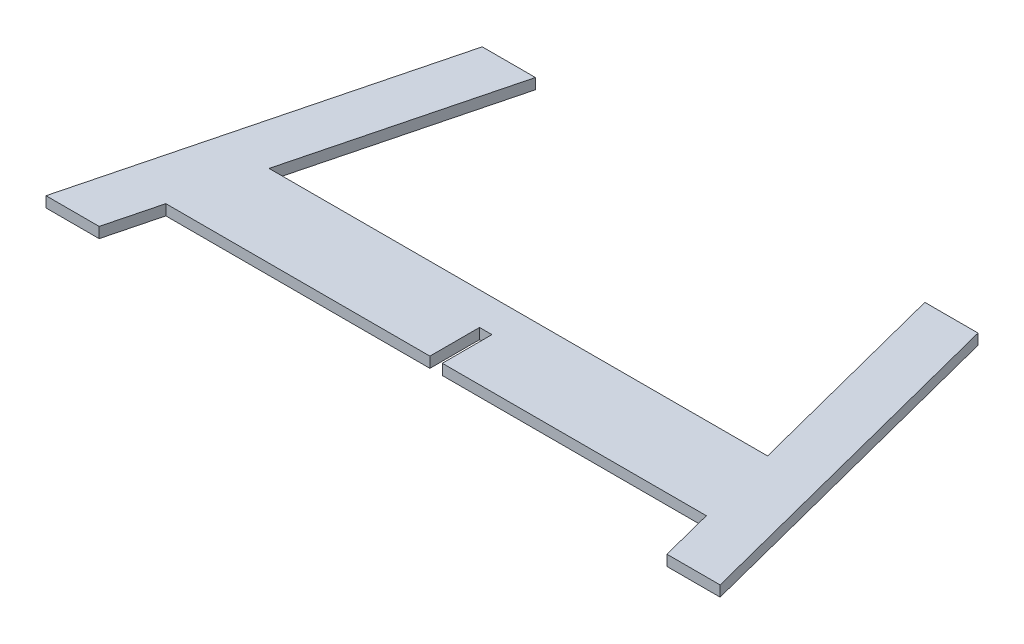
ISO-10303-21;
HEADER;
FILE_DESCRIPTION(('STEP AP214'),'2;1');
FILE_NAME('part.step','',(''),(''),'','','');
FILE_SCHEMA(('AUTOMOTIVE_DESIGN { 1 0 10303 214 1 1 1 1 }'));
ENDSEC;
DATA;
#1=APPLICATION_CONTEXT('core data for automotive mechanical design processes');
#2=APPLICATION_PROTOCOL_DEFINITION('international standard','automotive_design',2000,#1);
#3=PRODUCT_CONTEXT('',#1,'mechanical');
#4=PRODUCT('Part','Part','',(#3));
#5=PRODUCT_RELATED_PRODUCT_CATEGORY('part','',(#4));
#6=PRODUCT_DEFINITION_FORMATION('','',#4);
#7=PRODUCT_DEFINITION_CONTEXT('part definition',#1,'design');
#8=PRODUCT_DEFINITION('design','',#6,#7);
#9=PRODUCT_DEFINITION_SHAPE('','',#8);
#10=(LENGTH_UNIT() NAMED_UNIT(*) SI_UNIT(.MILLI.,.METRE.));
#11=(NAMED_UNIT(*) PLANE_ANGLE_UNIT() SI_UNIT($,.RADIAN.));
#12=(NAMED_UNIT(*) SI_UNIT($,.STERADIAN.) SOLID_ANGLE_UNIT());
#13=UNCERTAINTY_MEASURE_WITH_UNIT(LENGTH_MEASURE(1.E-05),#10,'distance_accuracy_value','');
#14=(GEOMETRIC_REPRESENTATION_CONTEXT(3) GLOBAL_UNCERTAINTY_ASSIGNED_CONTEXT((#13)) GLOBAL_UNIT_ASSIGNED_CONTEXT((#10,
#11,#12)) REPRESENTATION_CONTEXT('',''));
#15=CARTESIAN_POINT('',(0.,0.,0.));
#16=DIRECTION('',(0.,0.,1.));
#17=DIRECTION('',(1.,0.,0.));
#18=AXIS2_PLACEMENT_3D('',#15,#16,#17);
#19=CARTESIAN_POINT('',(-5.13148038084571,12.,-180.690415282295));
#20=DIRECTION('',(0.968532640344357,0.,0.248886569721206));
#21=DIRECTION('',(0.248886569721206,0.,-0.968532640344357));
#22=AXIS2_PLACEMENT_3D('',#19,#20,#21);
#23=PLANE('',#22);
#24=DIRECTION('',(-0.248886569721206,0.,0.968532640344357));
#25=VECTOR('',#24,1.);
#26=CARTESIAN_POINT('',(-5.13148038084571,0.,-180.690415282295));
#27=LINE('',#26,#25);
#28=CARTESIAN_POINT('',(-5.13148038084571,0.,-180.690415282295));
#29=VERTEX_POINT('',#28);
#30=CARTESIAN_POINT('',(-105.799867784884,0.,211.05679374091));
#31=VERTEX_POINT('',#30);
#32=EDGE_CURVE('E188',#29,#31,#27,.T.);
#33=ORIENTED_EDGE('',*,*,#32,.T.);
#34=DIRECTION('',(0.,-1.,0.));
#35=VECTOR('',#34,1.);
#36=CARTESIAN_POINT('',(-105.799867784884,12.,211.05679374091));
#37=LINE('',#36,#35);
#38=CARTESIAN_POINT('',(-105.799867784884,12.,211.05679374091));
#39=VERTEX_POINT('',#38);
#40=EDGE_CURVE('E11',#39,#31,#37,.T.);
#41=ORIENTED_EDGE('',*,*,#40,.F.);
#42=DIRECTION('',(-0.248886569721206,0.,0.968532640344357));
#43=VECTOR('',#42,1.);
#44=CARTESIAN_POINT('',(-5.13148038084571,12.,-180.690415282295));
#45=LINE('',#44,#43);
#46=CARTESIAN_POINT('',(-5.13148038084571,12.,-180.690415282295));
#47=VERTEX_POINT('',#46);
#48=EDGE_CURVE('E234',#47,#39,#45,.T.);
#49=ORIENTED_EDGE('',*,*,#48,.F.);
#50=DIRECTION('',(0.,-1.,0.));
#51=VECTOR('',#50,1.);
#52=CARTESIAN_POINT('',(-5.13148038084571,12.,-180.690415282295));
#53=LINE('',#52,#51);
#54=EDGE_CURVE('E184',#47,#29,#53,.T.);
#55=ORIENTED_EDGE('',*,*,#54,.T.);
#56=EDGE_LOOP('',(#33,#41,#49,#55));
#57=FACE_BOUND('',#56,.T.);
#58=ADVANCED_FACE('F39',(#57),#23,.F.);
#59=CARTESIAN_POINT('',(-105.799867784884,12.,211.05679374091));
#60=DIRECTION('',(0.,0.,-1.));
#61=DIRECTION('',(-1.,0.,0.));
#62=AXIS2_PLACEMENT_3D('',#59,#60,#61);
#63=PLANE('',#62);
#64=DIRECTION('',(1.,0.,0.));
#65=VECTOR('',#64,1.);
#66=CARTESIAN_POINT('',(-105.799867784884,0.,211.05679374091));
#67=LINE('',#66,#65);
#68=CARTESIAN_POINT('',(-45.7998677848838,0.,211.05679374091));
#69=VERTEX_POINT('',#68);
#70=EDGE_CURVE('E192',#31,#69,#67,.T.);
#71=ORIENTED_EDGE('',*,*,#70,.T.);
#72=DIRECTION('',(0.,-1.,0.));
#73=VECTOR('',#72,1.);
#74=CARTESIAN_POINT('',(-45.7998677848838,12.,211.05679374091));
#75=LINE('',#74,#73);
#76=CARTESIAN_POINT('',(-45.7998677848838,12.,211.05679374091));
#77=VERTEX_POINT('',#76);
#78=EDGE_CURVE('E48',#77,#69,#75,.T.);
#79=ORIENTED_EDGE('',*,*,#78,.F.);
#80=DIRECTION('',(1.,0.,0.));
#81=VECTOR('',#80,1.);
#82=CARTESIAN_POINT('',(-105.799867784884,12.,211.05679374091));
#83=LINE('',#82,#81);
#84=EDGE_CURVE('E123',#39,#77,#83,.T.);
#85=ORIENTED_EDGE('',*,*,#84,.F.);
#86=ORIENTED_EDGE('',*,*,#40,.T.);
#87=EDGE_LOOP('',(#71,#79,#85,#86));
#88=FACE_BOUND('',#87,.T.);
#89=ADVANCED_FACE('F356',(#88),#63,.F.);
#90=CARTESIAN_POINT('',(-45.7998677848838,12.,211.05679374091));
#91=DIRECTION('',(-0.968532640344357,0.,-0.248886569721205));
#92=DIRECTION('',(-0.248886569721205,0.,0.968532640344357));
#93=AXIS2_PLACEMENT_3D('',#90,#91,#92);
#94=PLANE('',#93);
#95=DIRECTION('',(0.248886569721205,0.,-0.968532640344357));
#96=VECTOR('',#95,1.);
#97=CARTESIAN_POINT('',(-45.7998677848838,0.,211.05679374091));
#98=LINE('',#97,#96);
#99=CARTESIAN_POINT('',(-30.4129774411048,0.,151.179293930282));
#100=VERTEX_POINT('',#99);
#101=EDGE_CURVE('E195',#69,#100,#98,.T.);
#102=ORIENTED_EDGE('',*,*,#101,.T.);
#103=DIRECTION('',(0.,-1.,0.));
#104=VECTOR('',#103,1.);
#105=CARTESIAN_POINT('',(-30.4129774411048,12.,151.179293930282));
#106=LINE('',#105,#104);
#107=CARTESIAN_POINT('',(-30.4129774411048,12.,151.179293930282));
#108=VERTEX_POINT('',#107);
#109=EDGE_CURVE('E277',#108,#100,#106,.T.);
#110=ORIENTED_EDGE('',*,*,#109,.F.);
#111=DIRECTION('',(0.248886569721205,0.,-0.968532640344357));
#112=VECTOR('',#111,1.);
#113=CARTESIAN_POINT('',(-45.7998677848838,12.,211.05679374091));
#114=LINE('',#113,#112);
#115=EDGE_CURVE('E287',#77,#108,#114,.T.);
#116=ORIENTED_EDGE('',*,*,#115,.F.);
#117=ORIENTED_EDGE('',*,*,#78,.T.);
#118=EDGE_LOOP('',(#102,#110,#116,#117));
#119=FACE_BOUND('',#118,.T.);
#120=ADVANCED_FACE('F285',(#119),#94,.F.);
#121=CARTESIAN_POINT('',(-30.4129774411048,12.,151.179293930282));
#122=DIRECTION('',(6.00403573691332E-06,0.,-0.999999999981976));
#123=DIRECTION('',(-0.999999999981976,0.,-6.00403573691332E-06));
#124=AXIS2_PLACEMENT_3D('',#121,#122,#123);
#125=PLANE('',#124);
#126=DIRECTION('',(0.999999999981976,0.,6.00403573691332E-06));
#127=VECTOR('',#126,1.);
#128=CARTESIAN_POINT('',(-30.4129774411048,0.,151.179293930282));
#129=LINE('',#128,#127);
#130=CARTESIAN_POINT('',(267.638519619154,0.,151.181083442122));
#131=VERTEX_POINT('',#130);
#132=EDGE_CURVE('E198',#100,#131,#129,.T.);
#133=ORIENTED_EDGE('',*,*,#132,.T.);
#134=DIRECTION('',(0.,-1.,0.));
#135=VECTOR('',#134,1.);
#136=CARTESIAN_POINT('',(267.638519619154,12.,151.181083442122));
#137=LINE('',#136,#135);
#138=CARTESIAN_POINT('',(267.638519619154,12.,151.181083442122));
#139=VERTEX_POINT('',#138);
#140=EDGE_CURVE('E273',#139,#131,#137,.T.);
#141=ORIENTED_EDGE('',*,*,#140,.F.);
#142=DIRECTION('',(0.999999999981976,0.,6.00403573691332E-06));
#143=VECTOR('',#142,1.);
#144=CARTESIAN_POINT('',(-30.4129774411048,12.,151.179293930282));
#145=LINE('',#144,#143);
#146=EDGE_CURVE('E306',#108,#139,#145,.T.);
#147=ORIENTED_EDGE('',*,*,#146,.F.);
#148=ORIENTED_EDGE('',*,*,#109,.T.);
#149=EDGE_LOOP('',(#133,#141,#147,#148));
#150=FACE_BOUND('',#149,.T.);
#151=ADVANCED_FACE('F296',(#150),#125,.F.);
#152=CARTESIAN_POINT('',(267.638519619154,12.,95.1810834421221));
#153=DIRECTION('',(-1.,0.,0.));
#154=DIRECTION('',(0.,0.,1.));
#155=AXIS2_PLACEMENT_3D('',#152,#153,#154);
#156=PLANE('',#155);
#157=DIRECTION('',(0.,0.,-1.));
#158=VECTOR('',#157,1.);
#159=CARTESIAN_POINT('',(267.638519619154,0.,95.1810834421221));
#160=LINE('',#159,#158);
#161=CARTESIAN_POINT('',(267.638519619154,0.,95.1810834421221));
#162=VERTEX_POINT('',#161);
#163=EDGE_CURVE('E201',#131,#162,#160,.T.);
#164=ORIENTED_EDGE('',*,*,#163,.T.);
#165=DIRECTION('',(0.,-1.,0.));
#166=VECTOR('',#165,1.);
#167=CARTESIAN_POINT('',(267.638519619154,12.,95.1810834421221));
#168=LINE('',#167,#166);
#169=CARTESIAN_POINT('',(267.638519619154,12.,95.1810834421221));
#170=VERTEX_POINT('',#169);
#171=EDGE_CURVE('E269',#170,#162,#168,.T.);
#172=ORIENTED_EDGE('',*,*,#171,.F.);
#173=DIRECTION('',(0.,0.,-1.));
#174=VECTOR('',#173,1.);
#175=CARTESIAN_POINT('',(267.638519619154,12.,95.1810834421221));
#176=LINE('',#175,#174);
#177=EDGE_CURVE('E302',#139,#170,#176,.T.);
#178=ORIENTED_EDGE('',*,*,#177,.F.);
#179=ORIENTED_EDGE('',*,*,#140,.T.);
#180=EDGE_LOOP('',(#164,#172,#178,#179));
#181=FACE_BOUND('',#180,.T.);
#182=ADVANCED_FACE('F300',(#181),#156,.F.);
#183=CARTESIAN_POINT('',(281.638519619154,12.,95.1810834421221));
#184=DIRECTION('',(0.,0.,-1.));
#185=DIRECTION('',(-1.,0.,0.));
#186=AXIS2_PLACEMENT_3D('',#183,#184,#185);
#187=PLANE('',#186);
#188=DIRECTION('',(1.,0.,0.));
#189=VECTOR('',#188,1.);
#190=CARTESIAN_POINT('',(281.638519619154,0.,95.1810834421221));
#191=LINE('',#190,#189);
#192=CARTESIAN_POINT('',(281.638519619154,0.,95.1810834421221));
#193=VERTEX_POINT('',#192);
#194=EDGE_CURVE('E204',#162,#193,#191,.T.);
#195=ORIENTED_EDGE('',*,*,#194,.T.);
#196=DIRECTION('',(0.,-1.,0.));
#197=VECTOR('',#196,1.);
#198=CARTESIAN_POINT('',(281.638519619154,12.,95.1810834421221));
#199=LINE('',#198,#197);
#200=CARTESIAN_POINT('',(281.638519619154,12.,95.1810834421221));
#201=VERTEX_POINT('',#200);
#202=EDGE_CURVE('E265',#201,#193,#199,.T.);
#203=ORIENTED_EDGE('',*,*,#202,.F.);
#204=DIRECTION('',(1.,0.,0.));
#205=VECTOR('',#204,1.);
#206=CARTESIAN_POINT('',(281.638519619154,12.,95.1810834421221));
#207=LINE('',#206,#205);
#208=EDGE_CURVE('E305',#170,#201,#207,.T.);
#209=ORIENTED_EDGE('',*,*,#208,.F.);
#210=ORIENTED_EDGE('',*,*,#171,.T.);
#211=EDGE_LOOP('',(#195,#203,#209,#210));
#212=FACE_BOUND('',#211,.T.);
#213=ADVANCED_FACE('F369',(#212),#187,.F.);
#214=CARTESIAN_POINT('',(281.638519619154,12.,151.179293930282));
#215=DIRECTION('',(1.,0.,0.));
#216=DIRECTION('',(0.,0.,-1.));
#217=AXIS2_PLACEMENT_3D('',#214,#215,#216);
#218=PLANE('',#217);
#219=DIRECTION('',(0.,0.,1.));
#220=VECTOR('',#219,1.);
#221=CARTESIAN_POINT('',(281.638519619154,0.,151.179293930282));
#222=LINE('',#221,#220);
#223=CARTESIAN_POINT('',(281.638519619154,0.,151.179293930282));
#224=VERTEX_POINT('',#223);
#225=EDGE_CURVE('E207',#193,#224,#222,.T.);
#226=ORIENTED_EDGE('',*,*,#225,.T.);
#227=DIRECTION('',(0.,-1.,0.));
#228=VECTOR('',#227,1.);
#229=CARTESIAN_POINT('',(281.638519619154,12.,151.179293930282));
#230=LINE('',#229,#228);
#231=CARTESIAN_POINT('',(281.638519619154,12.,151.179293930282));
#232=VERTEX_POINT('',#231);
#233=EDGE_CURVE('E261',#232,#224,#230,.T.);
#234=ORIENTED_EDGE('',*,*,#233,.F.);
#235=DIRECTION('',(0.,0.,1.));
#236=VECTOR('',#235,1.);
#237=CARTESIAN_POINT('',(281.638519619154,12.,151.179293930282));
#238=LINE('',#237,#236);
#239=EDGE_CURVE('E310',#201,#232,#238,.T.);
#240=ORIENTED_EDGE('',*,*,#239,.F.);
#241=ORIENTED_EDGE('',*,*,#202,.T.);
#242=EDGE_LOOP('',(#226,#234,#240,#241));
#243=FACE_BOUND('',#242,.T.);
#244=ADVANCED_FACE('F372',(#243),#218,.F.);
#245=CARTESIAN_POINT('',(281.638519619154,12.,151.179293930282));
#246=DIRECTION('',(0.,0.,-1.));
#247=DIRECTION('',(-1.,0.,0.));
#248=AXIS2_PLACEMENT_3D('',#245,#246,#247);
#249=PLANE('',#248);
#250=DIRECTION('',(1.,0.,0.));
#251=VECTOR('',#250,1.);
#252=CARTESIAN_POINT('',(281.638519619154,0.,151.179293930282));
#253=LINE('',#252,#251);
#254=CARTESIAN_POINT('',(579.690016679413,0.,151.179293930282));
#255=VERTEX_POINT('',#254);
#256=EDGE_CURVE('E210',#224,#255,#253,.T.);
#257=ORIENTED_EDGE('',*,*,#256,.T.);
#258=DIRECTION('',(0.,-1.,0.));
#259=VECTOR('',#258,1.);
#260=CARTESIAN_POINT('',(579.690016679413,12.,151.179293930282));
#261=LINE('',#260,#259);
#262=CARTESIAN_POINT('',(579.690016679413,12.,151.179293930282));
#263=VERTEX_POINT('',#262);
#264=EDGE_CURVE('E257',#263,#255,#261,.T.);
#265=ORIENTED_EDGE('',*,*,#264,.F.);
#266=DIRECTION('',(1.,0.,0.));
#267=VECTOR('',#266,1.);
#268=CARTESIAN_POINT('',(281.638519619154,12.,151.179293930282));
#269=LINE('',#268,#267);
#270=EDGE_CURVE('E317',#232,#263,#269,.T.);
#271=ORIENTED_EDGE('',*,*,#270,.F.);
#272=ORIENTED_EDGE('',*,*,#233,.T.);
#273=EDGE_LOOP('',(#257,#265,#271,#272));
#274=FACE_BOUND('',#273,.T.);
#275=ADVANCED_FACE('F376',(#274),#249,.F.);
#276=CARTESIAN_POINT('',(595.076907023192,12.,211.05679374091));
#277=DIRECTION('',(0.968532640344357,0.,-0.248886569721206));
#278=DIRECTION('',(-0.248886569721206,0.,-0.968532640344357));
#279=AXIS2_PLACEMENT_3D('',#276,#277,#278);
#280=PLANE('',#279);
#281=DIRECTION('',(0.248886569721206,0.,0.968532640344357));
#282=VECTOR('',#281,1.);
#283=CARTESIAN_POINT('',(595.076907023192,0.,211.05679374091));
#284=LINE('',#283,#282);
#285=CARTESIAN_POINT('',(595.076907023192,0.,211.05679374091));
#286=VERTEX_POINT('',#285);
#287=EDGE_CURVE('E213',#255,#286,#284,.T.);
#288=ORIENTED_EDGE('',*,*,#287,.T.);
#289=DIRECTION('',(0.,-1.,0.));
#290=VECTOR('',#289,1.);
#291=CARTESIAN_POINT('',(595.076907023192,12.,211.05679374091));
#292=LINE('',#291,#290);
#293=CARTESIAN_POINT('',(595.076907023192,12.,211.05679374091));
#294=VERTEX_POINT('',#293);
#295=EDGE_CURVE('E253',#294,#286,#292,.T.);
#296=ORIENTED_EDGE('',*,*,#295,.F.);
#297=DIRECTION('',(0.248886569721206,0.,0.968532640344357));
#298=VECTOR('',#297,1.);
#299=CARTESIAN_POINT('',(595.076907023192,12.,211.05679374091));
#300=LINE('',#299,#298);
#301=EDGE_CURVE('E320',#263,#294,#300,.T.);
#302=ORIENTED_EDGE('',*,*,#301,.F.);
#303=ORIENTED_EDGE('',*,*,#264,.T.);
#304=EDGE_LOOP('',(#288,#296,#302,#303));
#305=FACE_BOUND('',#304,.T.);
#306=ADVANCED_FACE('F380',(#305),#280,.F.);
#307=CARTESIAN_POINT('',(655.076907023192,12.,211.05679374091));
#308=DIRECTION('',(0.,0.,-1.));
#309=DIRECTION('',(-1.,0.,0.));
#310=AXIS2_PLACEMENT_3D('',#307,#308,#309);
#311=PLANE('',#310);
#312=DIRECTION('',(1.,0.,0.));
#313=VECTOR('',#312,1.);
#314=CARTESIAN_POINT('',(655.076907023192,0.,211.05679374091));
#315=LINE('',#314,#313);
#316=CARTESIAN_POINT('',(655.076907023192,0.,211.05679374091));
#317=VERTEX_POINT('',#316);
#318=EDGE_CURVE('E216',#286,#317,#315,.T.);
#319=ORIENTED_EDGE('',*,*,#318,.T.);
#320=DIRECTION('',(0.,-1.,0.));
#321=VECTOR('',#320,1.);
#322=CARTESIAN_POINT('',(655.076907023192,12.,211.05679374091));
#323=LINE('',#322,#321);
#324=CARTESIAN_POINT('',(655.076907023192,12.,211.05679374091));
#325=VERTEX_POINT('',#324);
#326=EDGE_CURVE('E249',#325,#317,#323,.T.);
#327=ORIENTED_EDGE('',*,*,#326,.F.);
#328=DIRECTION('',(1.,0.,0.));
#329=VECTOR('',#328,1.);
#330=CARTESIAN_POINT('',(655.076907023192,12.,211.05679374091));
#331=LINE('',#330,#329);
#332=EDGE_CURVE('E323',#294,#325,#331,.T.);
#333=ORIENTED_EDGE('',*,*,#332,.F.);
#334=ORIENTED_EDGE('',*,*,#295,.T.);
#335=EDGE_LOOP('',(#319,#327,#333,#334));
#336=FACE_BOUND('',#335,.T.);
#337=ADVANCED_FACE('F384',(#336),#311,.F.);
#338=CARTESIAN_POINT('',(554.408519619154,12.,-180.690415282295));
#339=DIRECTION('',(-0.968532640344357,0.,0.248886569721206));
#340=DIRECTION('',(0.248886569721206,0.,0.968532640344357));
#341=AXIS2_PLACEMENT_3D('',#338,#339,#340);
#342=PLANE('',#341);
#343=DIRECTION('',(-0.248886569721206,0.,-0.968532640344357));
#344=VECTOR('',#343,1.);
#345=CARTESIAN_POINT('',(554.408519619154,0.,-180.690415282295));
#346=LINE('',#345,#344);
#347=CARTESIAN_POINT('',(554.408519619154,0.,-180.690415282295));
#348=VERTEX_POINT('',#347);
#349=EDGE_CURVE('E219',#317,#348,#346,.T.);
#350=ORIENTED_EDGE('',*,*,#349,.T.);
#351=DIRECTION('',(0.,-1.,0.));
#352=VECTOR('',#351,1.);
#353=CARTESIAN_POINT('',(554.408519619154,12.,-180.690415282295));
#354=LINE('',#353,#352);
#355=CARTESIAN_POINT('',(554.408519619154,12.,-180.690415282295));
#356=VERTEX_POINT('',#355);
#357=EDGE_CURVE('E245',#356,#348,#354,.T.);
#358=ORIENTED_EDGE('',*,*,#357,.F.);
#359=DIRECTION('',(-0.248886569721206,0.,-0.968532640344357));
#360=VECTOR('',#359,1.);
#361=CARTESIAN_POINT('',(554.408519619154,12.,-180.690415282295));
#362=LINE('',#361,#360);
#363=EDGE_CURVE('E326',#325,#356,#362,.T.);
#364=ORIENTED_EDGE('',*,*,#363,.F.);
#365=ORIENTED_EDGE('',*,*,#326,.T.);
#366=EDGE_LOOP('',(#350,#358,#364,#365));
#367=FACE_BOUND('',#366,.T.);
#368=ADVANCED_FACE('F388',(#367),#342,.F.);
#369=CARTESIAN_POINT('',(554.408519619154,12.,-180.690415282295));
#370=DIRECTION('',(0.,0.,1.));
#371=DIRECTION('',(1.,0.,0.));
#372=AXIS2_PLACEMENT_3D('',#369,#370,#371);
#373=PLANE('',#372);
#374=DIRECTION('',(-1.,0.,0.));
#375=VECTOR('',#374,1.);
#376=CARTESIAN_POINT('',(554.408519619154,0.,-180.690415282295));
#377=LINE('',#376,#375);
#378=CARTESIAN_POINT('',(494.408519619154,0.,-180.690415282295));
#379=VERTEX_POINT('',#378);
#380=EDGE_CURVE('E222',#348,#379,#377,.T.);
#381=ORIENTED_EDGE('',*,*,#380,.T.);
#382=DIRECTION('',(0.,-1.,0.));
#383=VECTOR('',#382,1.);
#384=CARTESIAN_POINT('',(494.408519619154,12.,-180.690415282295));
#385=LINE('',#384,#383);
#386=CARTESIAN_POINT('',(494.408519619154,12.,-180.690415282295));
#387=VERTEX_POINT('',#386);
#388=EDGE_CURVE('E241',#387,#379,#385,.T.);
#389=ORIENTED_EDGE('',*,*,#388,.F.);
#390=DIRECTION('',(-1.,0.,0.));
#391=VECTOR('',#390,1.);
#392=CARTESIAN_POINT('',(554.408519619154,12.,-180.690415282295));
#393=LINE('',#392,#391);
#394=EDGE_CURVE('E329',#356,#387,#393,.T.);
#395=ORIENTED_EDGE('',*,*,#394,.F.);
#396=ORIENTED_EDGE('',*,*,#357,.T.);
#397=EDGE_LOOP('',(#381,#389,#395,#396));
#398=FACE_BOUND('',#397,.T.);
#399=ADVANCED_FACE('F337',(#398),#373,.F.);
#400=CARTESIAN_POINT('',(494.408519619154,12.,-180.690415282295));
#401=DIRECTION('',(0.968532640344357,0.,-0.248886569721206));
#402=DIRECTION('',(-0.248886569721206,0.,-0.968532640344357));
#403=AXIS2_PLACEMENT_3D('',#400,#401,#402);
#404=PLANE('',#403);
#405=DIRECTION('',(0.248886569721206,0.,0.968532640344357));
#406=VECTOR('',#405,1.);
#407=CARTESIAN_POINT('',(494.408519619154,0.,-180.690415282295));
#408=LINE('',#407,#406);
#409=CARTESIAN_POINT('',(555.794060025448,0.,58.1890855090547));
#410=VERTEX_POINT('',#409);
#411=EDGE_CURVE('E225',#379,#410,#408,.T.);
#412=ORIENTED_EDGE('',*,*,#411,.T.);
#413=DIRECTION('',(0.,-1.,0.));
#414=VECTOR('',#413,1.);
#415=CARTESIAN_POINT('',(555.794060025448,12.,58.1890855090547));
#416=LINE('',#415,#414);
#417=CARTESIAN_POINT('',(555.794060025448,12.,58.1890855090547));
#418=VERTEX_POINT('',#417);
#419=EDGE_CURVE('E177',#418,#410,#416,.T.);
#420=ORIENTED_EDGE('',*,*,#419,.F.);
#421=DIRECTION('',(0.248886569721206,0.,0.968532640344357));
#422=VECTOR('',#421,1.);
#423=CARTESIAN_POINT('',(494.408519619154,12.,-180.690415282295));
#424=LINE('',#423,#422);
#425=EDGE_CURVE('E166',#387,#418,#424,.T.);
#426=ORIENTED_EDGE('',*,*,#425,.F.);
#427=ORIENTED_EDGE('',*,*,#388,.T.);
#428=EDGE_LOOP('',(#412,#420,#426,#427));
#429=FACE_BOUND('',#428,.T.);
#430=ADVANCED_FACE('F341',(#429),#404,.F.);
#431=CARTESIAN_POINT('',(-6.597472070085,12.,58.5021586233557));
#432=DIRECTION('',(0.000556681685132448,0.,0.999999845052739));
#433=DIRECTION('',(0.999999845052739,0.,-0.000556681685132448));
#434=AXIS2_PLACEMENT_3D('',#431,#432,#433);
#435=PLANE('',#434);
#436=DIRECTION('',(-0.999999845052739,0.,0.000556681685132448));
#437=VECTOR('',#436,1.);
#438=CARTESIAN_POINT('',(-6.597472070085,0.,58.5021586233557));
#439=LINE('',#438,#437);
#440=CARTESIAN_POINT('',(-6.597472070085,0.,58.5021586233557));
#441=VERTEX_POINT('',#440);
#442=EDGE_CURVE('E175',#410,#441,#439,.T.);
#443=ORIENTED_EDGE('',*,*,#442,.T.);
#444=DIRECTION('',(0.,-1.,0.));
#445=VECTOR('',#444,1.);
#446=CARTESIAN_POINT('',(-6.597472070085,12.,58.5021586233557));
#447=LINE('',#446,#445);
#448=CARTESIAN_POINT('',(-6.597472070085,12.,58.5021586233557));
#449=VERTEX_POINT('',#448);
#450=EDGE_CURVE('E172',#449,#441,#447,.T.);
#451=ORIENTED_EDGE('',*,*,#450,.F.);
#452=DIRECTION('',(-0.999999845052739,0.,0.000556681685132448));
#453=VECTOR('',#452,1.);
#454=CARTESIAN_POINT('',(-6.597472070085,12.,58.5021586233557));
#455=LINE('',#454,#453);
#456=EDGE_CURVE('E160',#418,#449,#455,.T.);
#457=ORIENTED_EDGE('',*,*,#456,.F.);
#458=ORIENTED_EDGE('',*,*,#419,.T.);
#459=EDGE_LOOP('',(#443,#451,#457,#458));
#460=FACE_BOUND('',#459,.T.);
#461=ADVANCED_FACE('F173',(#460),#435,.F.);
#462=CARTESIAN_POINT('',(54.8685196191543,12.,-180.690415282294));
#463=DIRECTION('',(-0.968532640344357,0.,-0.248886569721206));
#464=DIRECTION('',(-0.248886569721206,0.,0.968532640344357));
#465=AXIS2_PLACEMENT_3D('',#462,#463,#464);
#466=PLANE('',#465);
#467=DIRECTION('',(0.248886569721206,0.,-0.968532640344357));
#468=VECTOR('',#467,1.);
#469=CARTESIAN_POINT('',(54.8685196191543,0.,-180.690415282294));
#470=LINE('',#469,#468);
#471=CARTESIAN_POINT('',(54.8685196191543,0.,-180.690415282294));
#472=VERTEX_POINT('',#471);
#473=EDGE_CURVE('E109',#441,#472,#470,.T.);
#474=ORIENTED_EDGE('',*,*,#473,.T.);
#475=DIRECTION('',(0.,-1.,0.));
#476=VECTOR('',#475,1.);
#477=CARTESIAN_POINT('',(54.8685196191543,12.,-180.690415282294));
#478=LINE('',#477,#476);
#479=CARTESIAN_POINT('',(54.8685196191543,12.,-180.690415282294));
#480=VERTEX_POINT('',#479);
#481=EDGE_CURVE('E178',#480,#472,#478,.T.);
#482=ORIENTED_EDGE('',*,*,#481,.F.);
#483=DIRECTION('',(0.248886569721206,0.,-0.968532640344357));
#484=VECTOR('',#483,1.);
#485=CARTESIAN_POINT('',(54.8685196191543,12.,-180.690415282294));
#486=LINE('',#485,#484);
#487=EDGE_CURVE('E164',#449,#480,#486,.T.);
#488=ORIENTED_EDGE('',*,*,#487,.F.);
#489=ORIENTED_EDGE('',*,*,#450,.T.);
#490=EDGE_LOOP('',(#474,#482,#488,#489));
#491=FACE_BOUND('',#490,.T.);
#492=ADVANCED_FACE('F180',(#491),#466,.F.);
#493=CARTESIAN_POINT('',(-5.13148038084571,12.,-180.690415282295));
#494=DIRECTION('',(0.,0.,1.));
#495=DIRECTION('',(1.,0.,0.));
#496=AXIS2_PLACEMENT_3D('',#493,#494,#495);
#497=PLANE('',#496);
#498=DIRECTION('',(-1.,0.,0.));
#499=VECTOR('',#498,1.);
#500=CARTESIAN_POINT('',(-5.13148038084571,0.,-180.690415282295));
#501=LINE('',#500,#499);
#502=EDGE_CURVE('E115',#472,#29,#501,.T.);
#503=ORIENTED_EDGE('',*,*,#502,.T.);
#504=ORIENTED_EDGE('',*,*,#54,.F.);
#505=DIRECTION('',(-1.,0.,0.));
#506=VECTOR('',#505,1.);
#507=CARTESIAN_POINT('',(-5.13148038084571,12.,-180.690415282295));
#508=LINE('',#507,#506);
#509=EDGE_CURVE('E56',#480,#47,#508,.T.);
#510=ORIENTED_EDGE('',*,*,#509,.F.);
#511=ORIENTED_EDGE('',*,*,#481,.T.);
#512=EDGE_LOOP('',(#503,#504,#510,#511));
#513=FACE_BOUND('',#512,.T.);
#514=ADVANCED_FACE('F345',(#513),#497,.F.);
#515=CARTESIAN_POINT('',(0.,12.,0.));
#516=DIRECTION('',(0.,1.,0.));
#517=DIRECTION('',(0.,0.,1.));
#518=AXIS2_PLACEMENT_3D('',#515,#516,#517);
#519=PLANE('',#518);
#520=ORIENTED_EDGE('',*,*,#48,.T.);
#521=ORIENTED_EDGE('',*,*,#84,.T.);
#522=ORIENTED_EDGE('',*,*,#115,.T.);
#523=ORIENTED_EDGE('',*,*,#146,.T.);
#524=ORIENTED_EDGE('',*,*,#177,.T.);
#525=ORIENTED_EDGE('',*,*,#208,.T.);
#526=ORIENTED_EDGE('',*,*,#239,.T.);
#527=ORIENTED_EDGE('',*,*,#270,.T.);
#528=ORIENTED_EDGE('',*,*,#301,.T.);
#529=ORIENTED_EDGE('',*,*,#332,.T.);
#530=ORIENTED_EDGE('',*,*,#363,.T.);
#531=ORIENTED_EDGE('',*,*,#394,.T.);
#532=ORIENTED_EDGE('',*,*,#425,.T.);
#533=ORIENTED_EDGE('',*,*,#456,.T.);
#534=ORIENTED_EDGE('',*,*,#487,.T.);
#535=ORIENTED_EDGE('',*,*,#509,.T.);
#536=EDGE_LOOP('',(#520,#521,#522,#523,#524,#525,#526,#527,#528,#529,#530,#531,#532,#533,#534,#535));
#537=FACE_BOUND('',#536,.T.);
#538=ADVANCED_FACE('F162',(#537),#519,.T.);
#539=CARTESIAN_POINT('',(0.,0.,0.));
#540=DIRECTION('',(0.,1.,0.));
#541=DIRECTION('',(0.,0.,1.));
#542=AXIS2_PLACEMENT_3D('',#539,#540,#541);
#543=PLANE('',#542);
#544=ORIENTED_EDGE('',*,*,#32,.F.);
#545=ORIENTED_EDGE('',*,*,#502,.F.);
#546=ORIENTED_EDGE('',*,*,#473,.F.);
#547=ORIENTED_EDGE('',*,*,#442,.F.);
#548=ORIENTED_EDGE('',*,*,#411,.F.);
#549=ORIENTED_EDGE('',*,*,#380,.F.);
#550=ORIENTED_EDGE('',*,*,#349,.F.);
#551=ORIENTED_EDGE('',*,*,#318,.F.);
#552=ORIENTED_EDGE('',*,*,#287,.F.);
#553=ORIENTED_EDGE('',*,*,#256,.F.);
#554=ORIENTED_EDGE('',*,*,#225,.F.);
#555=ORIENTED_EDGE('',*,*,#194,.F.);
#556=ORIENTED_EDGE('',*,*,#163,.F.);
#557=ORIENTED_EDGE('',*,*,#132,.F.);
#558=ORIENTED_EDGE('',*,*,#101,.F.);
#559=ORIENTED_EDGE('',*,*,#70,.F.);
#560=EDGE_LOOP('',(#544,#545,#546,#547,#548,#549,#550,#551,#552,#553,#554,#555,#556,#557,#558,#559));
#561=FACE_BOUND('',#560,.T.);
#562=ADVANCED_FACE('F291',(#561),#543,.F.);
#563=CLOSED_SHELL('',(#58,#89,#120,#151,#182,#213,#244,#275,#306,#337,#368,#399,#430,#461,#492,
#514,#538,#562));
#564=MANIFOLD_SOLID_BREP('B2',#563);
#565=ADVANCED_BREP_SHAPE_REPRESENTATION('',(#18,#564),#14);
#566=SHAPE_DEFINITION_REPRESENTATION(#9,#565);
ENDSEC;
END-ISO-10303-21;
